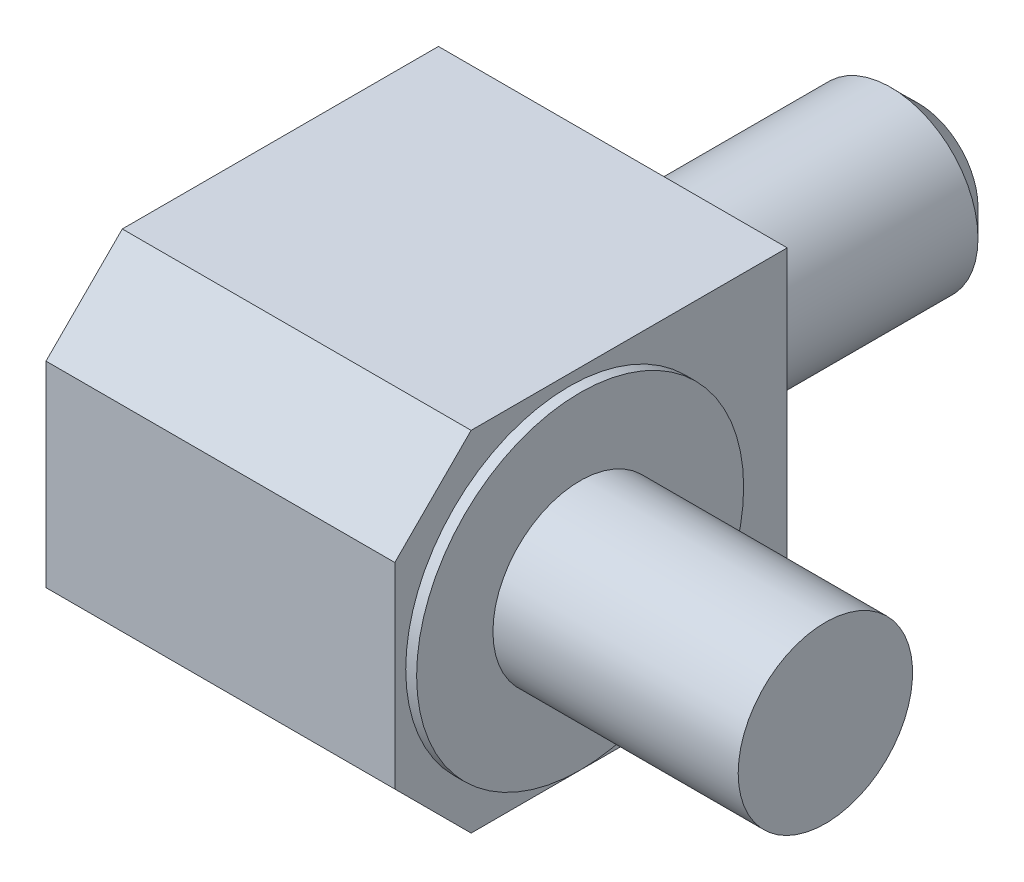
ISO-10303-21;
HEADER;
FILE_DESCRIPTION(('STEP AP214'),'2;1');
FILE_NAME('part.step','',(''),(''),'','','');
FILE_SCHEMA(('AUTOMOTIVE_DESIGN { 1 0 10303 214 1 1 1 1 }'));
ENDSEC;
DATA;
#1=APPLICATION_CONTEXT('core data for automotive mechanical design processes');
#2=APPLICATION_PROTOCOL_DEFINITION('international standard','automotive_design',2000,#1);
#3=PRODUCT_CONTEXT('',#1,'mechanical');
#4=PRODUCT('Part','Part','',(#3));
#5=PRODUCT_RELATED_PRODUCT_CATEGORY('part','',(#4));
#6=PRODUCT_DEFINITION_FORMATION('','',#4);
#7=PRODUCT_DEFINITION_CONTEXT('part definition',#1,'design');
#8=PRODUCT_DEFINITION('design','',#6,#7);
#9=PRODUCT_DEFINITION_SHAPE('','',#8);
#10=(LENGTH_UNIT() NAMED_UNIT(*) SI_UNIT(.MILLI.,.METRE.));
#11=(NAMED_UNIT(*) PLANE_ANGLE_UNIT() SI_UNIT($,.RADIAN.));
#12=(NAMED_UNIT(*) SI_UNIT($,.STERADIAN.) SOLID_ANGLE_UNIT());
#13=UNCERTAINTY_MEASURE_WITH_UNIT(LENGTH_MEASURE(1.E-05),#10,'distance_accuracy_value','');
#14=(GEOMETRIC_REPRESENTATION_CONTEXT(3) GLOBAL_UNCERTAINTY_ASSIGNED_CONTEXT((#13)) GLOBAL_UNIT_ASSIGNED_CONTEXT((#10,
#11,#12)) REPRESENTATION_CONTEXT('',''));
#15=CARTESIAN_POINT('',(0.,0.,0.));
#16=DIRECTION('',(0.,0.,1.));
#17=DIRECTION('',(1.,0.,0.));
#18=AXIS2_PLACEMENT_3D('',#15,#16,#17);
#19=CARTESIAN_POINT('',(8.,8.,0.));
#20=DIRECTION('',(-1.,0.,0.));
#21=DIRECTION('',(0.,0.,-1.));
#22=AXIS2_PLACEMENT_3D('',#19,#20,#21);
#23=PLANE('',#22);
#24=DIRECTION('',(0.,1.,0.));
#25=VECTOR('',#24,1.);
#26=CARTESIAN_POINT('',(8.,-8.,18.));
#27=LINE('',#26,#25);
#28=CARTESIAN_POINT('',(8.,-4.5,18.));
#29=VERTEX_POINT('',#28);
#30=CARTESIAN_POINT('',(8.,4.49999999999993,18.));
#31=VERTEX_POINT('',#30);
#32=EDGE_CURVE('E109',#29,#31,#27,.T.);
#33=ORIENTED_EDGE('',*,*,#32,.F.);
#34=DIRECTION('',(0.,-0.707106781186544,-0.707106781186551));
#35=VECTOR('',#34,1.);
#36=CARTESIAN_POINT('',(8.,-8.,14.5));
#37=LINE('',#36,#35);
#38=CARTESIAN_POINT('',(8.,-8.,14.5));
#39=VERTEX_POINT('',#38);
#40=EDGE_CURVE('E124',#29,#39,#37,.T.);
#41=ORIENTED_EDGE('',*,*,#40,.T.);
#42=DIRECTION('',(0.,0.,-1.));
#43=VECTOR('',#42,1.);
#44=CARTESIAN_POINT('',(8.,-8.,18.));
#45=LINE('',#44,#43);
#46=CARTESIAN_POINT('',(8.,-8.,0.));
#47=VERTEX_POINT('',#46);
#48=EDGE_CURVE('E107',#39,#47,#45,.T.);
#49=ORIENTED_EDGE('',*,*,#48,.T.);
#50=DIRECTION('',(0.,-1.,0.));
#51=VECTOR('',#50,1.);
#52=CARTESIAN_POINT('',(8.,8.,0.));
#53=LINE('',#52,#51);
#54=CARTESIAN_POINT('',(8.,8.,0.));
#55=VERTEX_POINT('',#54);
#56=EDGE_CURVE('E89',#55,#47,#53,.T.);
#57=ORIENTED_EDGE('',*,*,#56,.F.);
#58=DIRECTION('',(0.,0.,1.));
#59=VECTOR('',#58,1.);
#60=CARTESIAN_POINT('',(8.,8.,0.));
#61=LINE('',#60,#59);
#62=CARTESIAN_POINT('',(8.,8.,14.5));
#63=VERTEX_POINT('',#62);
#64=EDGE_CURVE('E91',#55,#63,#61,.T.);
#65=ORIENTED_EDGE('',*,*,#64,.T.);
#66=DIRECTION('',(0.,-0.707106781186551,0.707106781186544));
#67=VECTOR('',#66,1.);
#68=CARTESIAN_POINT('',(8.,4.49999999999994,18.));
#69=LINE('',#68,#67);
#70=EDGE_CURVE('E36',#63,#31,#69,.T.);
#71=ORIENTED_EDGE('',*,*,#70,.T.);
#72=EDGE_LOOP('',(#33,#41,#49,#57,#65,#71));
#73=FACE_BOUND('',#72,.T.);
#74=CARTESIAN_POINT('',(8.,0.,10.));
#75=DIRECTION('',(-1.,0.,0.));
#76=DIRECTION('',(0.,0.,-1.));
#77=AXIS2_PLACEMENT_3D('',#74,#75,#76);
#78=CIRCLE('',#77,7.5);
#79=CARTESIAN_POINT('',(8.,0.,2.5));
#80=VERTEX_POINT('',#79);
#81=EDGE_CURVE('E130',#80,#80,#78,.F.);
#82=ORIENTED_EDGE('',*,*,#81,.F.);
#83=EDGE_LOOP('',(#82));
#84=FACE_BOUND('',#83,.T.);
#85=ADVANCED_FACE('F14',(#73,#84),#23,.F.);
#86=CARTESIAN_POINT('',(8.,8.,0.));
#87=DIRECTION('',(0.,0.,-1.));
#88=DIRECTION('',(1.,0.,0.));
#89=AXIS2_PLACEMENT_3D('',#86,#87,#88);
#90=PLANE('',#89);
#91=CARTESIAN_POINT('',(0.,0.,0.));
#92=DIRECTION('',(0.,0.,-1.));
#93=DIRECTION('',(1.,0.,0.));
#94=AXIS2_PLACEMENT_3D('',#91,#92,#93);
#95=CIRCLE('',#94,4.);
#96=CARTESIAN_POINT('',(4.,0.,0.));
#97=VERTEX_POINT('',#96);
#98=EDGE_CURVE('E101',#97,#97,#95,.T.);
#99=ORIENTED_EDGE('',*,*,#98,.F.);
#100=EDGE_LOOP('',(#99));
#101=FACE_BOUND('',#100,.T.);
#102=DIRECTION('',(-1.,0.,0.));
#103=VECTOR('',#102,1.);
#104=CARTESIAN_POINT('',(8.,8.,0.));
#105=LINE('',#104,#103);
#106=CARTESIAN_POINT('',(-8.,8.,0.));
#107=VERTEX_POINT('',#106);
#108=EDGE_CURVE('E90',#55,#107,#105,.T.);
#109=ORIENTED_EDGE('',*,*,#108,.F.);
#110=ORIENTED_EDGE('',*,*,#56,.T.);
#111=DIRECTION('',(-1.,0.,0.));
#112=VECTOR('',#111,1.);
#113=CARTESIAN_POINT('',(8.,-8.,0.));
#114=LINE('',#113,#112);
#115=CARTESIAN_POINT('',(-8.,-8.,0.));
#116=VERTEX_POINT('',#115);
#117=EDGE_CURVE('E75',#47,#116,#114,.T.);
#118=ORIENTED_EDGE('',*,*,#117,.T.);
#119=DIRECTION('',(0.,-1.,0.));
#120=VECTOR('',#119,1.);
#121=CARTESIAN_POINT('',(-8.,8.,0.));
#122=LINE('',#121,#120);
#123=EDGE_CURVE('E82',#107,#116,#122,.T.);
#124=ORIENTED_EDGE('',*,*,#123,.F.);
#125=EDGE_LOOP('',(#109,#110,#118,#124));
#126=FACE_BOUND('',#125,.T.);
#127=ADVANCED_FACE('F86',(#101,#126),#90,.T.);
#128=CARTESIAN_POINT('',(8.,8.,0.));
#129=DIRECTION('',(0.,-1.,0.));
#130=DIRECTION('',(1.,0.,0.));
#131=AXIS2_PLACEMENT_3D('',#128,#129,#130);
#132=PLANE('',#131);
#133=DIRECTION('',(0.,0.,1.));
#134=VECTOR('',#133,1.);
#135=CARTESIAN_POINT('',(-8.,8.,0.));
#136=LINE('',#135,#134);
#137=CARTESIAN_POINT('',(-8.,8.,14.5));
#138=VERTEX_POINT('',#137);
#139=EDGE_CURVE('E94',#107,#138,#136,.T.);
#140=ORIENTED_EDGE('',*,*,#139,.T.);
#141=DIRECTION('',(1.,0.,0.));
#142=VECTOR('',#141,1.);
#143=CARTESIAN_POINT('',(8.,8.,14.5));
#144=LINE('',#143,#142);
#145=EDGE_CURVE('E29',#138,#63,#144,.T.);
#146=ORIENTED_EDGE('',*,*,#145,.T.);
#147=ORIENTED_EDGE('',*,*,#64,.F.);
#148=ORIENTED_EDGE('',*,*,#108,.T.);
#149=EDGE_LOOP('',(#140,#146,#147,#148));
#150=FACE_BOUND('',#149,.T.);
#151=ADVANCED_FACE('F155',(#150),#132,.F.);
#152=CARTESIAN_POINT('',(8.,-8.,18.));
#153=DIRECTION('',(0.,0.,1.));
#154=DIRECTION('',(0.,-1.,0.));
#155=AXIS2_PLACEMENT_3D('',#152,#153,#154);
#156=PLANE('',#155);
#157=DIRECTION('',(0.,1.,0.));
#158=VECTOR('',#157,1.);
#159=CARTESIAN_POINT('',(-8.,-8.,18.));
#160=LINE('',#159,#158);
#161=CARTESIAN_POINT('',(-8.,-4.5,18.));
#162=VERTEX_POINT('',#161);
#163=CARTESIAN_POINT('',(-8.,4.49999999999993,18.));
#164=VERTEX_POINT('',#163);
#165=EDGE_CURVE('E81',#162,#164,#160,.T.);
#166=ORIENTED_EDGE('',*,*,#165,.F.);
#167=DIRECTION('',(1.,0.,0.));
#168=VECTOR('',#167,1.);
#169=CARTESIAN_POINT('',(8.,-4.5,18.));
#170=LINE('',#169,#168);
#171=EDGE_CURVE('E121',#162,#29,#170,.T.);
#172=ORIENTED_EDGE('',*,*,#171,.T.);
#173=ORIENTED_EDGE('',*,*,#32,.T.);
#174=DIRECTION('',(-1.,0.,0.));
#175=VECTOR('',#174,1.);
#176=CARTESIAN_POINT('',(-8.,4.49999999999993,18.));
#177=LINE('',#176,#175);
#178=EDGE_CURVE('E118',#31,#164,#177,.T.);
#179=ORIENTED_EDGE('',*,*,#178,.T.);
#180=EDGE_LOOP('',(#166,#172,#173,#179));
#181=FACE_BOUND('',#180,.T.);
#182=ADVANCED_FACE('F164',(#181),#156,.T.);
#183=CARTESIAN_POINT('',(8.,-8.,18.));
#184=DIRECTION('',(0.,1.,0.));
#185=DIRECTION('',(0.,0.,1.));
#186=AXIS2_PLACEMENT_3D('',#183,#184,#185);
#187=PLANE('',#186);
#188=ORIENTED_EDGE('',*,*,#48,.F.);
#189=DIRECTION('',(-1.,0.,0.));
#190=VECTOR('',#189,1.);
#191=CARTESIAN_POINT('',(-8.,-8.,14.5));
#192=LINE('',#191,#190);
#193=CARTESIAN_POINT('',(-8.,-8.,14.5));
#194=VERTEX_POINT('',#193);
#195=EDGE_CURVE('E78',#39,#194,#192,.T.);
#196=ORIENTED_EDGE('',*,*,#195,.T.);
#197=DIRECTION('',(0.,0.,-1.));
#198=VECTOR('',#197,1.);
#199=CARTESIAN_POINT('',(-8.,-8.,18.));
#200=LINE('',#199,#198);
#201=EDGE_CURVE('E71',#194,#116,#200,.T.);
#202=ORIENTED_EDGE('',*,*,#201,.T.);
#203=ORIENTED_EDGE('',*,*,#117,.F.);
#204=EDGE_LOOP('',(#188,#196,#202,#203));
#205=FACE_BOUND('',#204,.T.);
#206=ADVANCED_FACE('F74',(#205),#187,.F.);
#207=CARTESIAN_POINT('',(-8.,8.,0.));
#208=DIRECTION('',(-1.,0.,0.));
#209=DIRECTION('',(0.,0.,-1.));
#210=AXIS2_PLACEMENT_3D('',#207,#208,#209);
#211=PLANE('',#210);
#212=ORIENTED_EDGE('',*,*,#201,.F.);
#213=DIRECTION('',(0.,0.707106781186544,0.707106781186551));
#214=VECTOR('',#213,1.);
#215=CARTESIAN_POINT('',(-8.,-7.25,15.25));
#216=LINE('',#215,#214);
#217=EDGE_CURVE('E116',#194,#162,#216,.T.);
#218=ORIENTED_EDGE('',*,*,#217,.T.);
#219=ORIENTED_EDGE('',*,*,#165,.T.);
#220=DIRECTION('',(0.,0.707106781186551,-0.707106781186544));
#221=VECTOR('',#220,1.);
#222=CARTESIAN_POINT('',(-8.,15.25,7.25));
#223=LINE('',#222,#221);
#224=EDGE_CURVE('E114',#164,#138,#223,.T.);
#225=ORIENTED_EDGE('',*,*,#224,.T.);
#226=ORIENTED_EDGE('',*,*,#139,.F.);
#227=ORIENTED_EDGE('',*,*,#123,.T.);
#228=EDGE_LOOP('',(#212,#218,#219,#225,#226,#227));
#229=FACE_BOUND('',#228,.T.);
#230=ADVANCED_FACE('F93',(#229),#211,.T.);
#231=CARTESIAN_POINT('',(8.,-8.,14.5));
#232=DIRECTION('',(0.,-0.707106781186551,0.707106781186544));
#233=DIRECTION('',(0.,-0.707106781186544,-0.707106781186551));
#234=AXIS2_PLACEMENT_3D('',#231,#232,#233);
#235=PLANE('',#234);
#236=ORIENTED_EDGE('',*,*,#40,.F.);
#237=ORIENTED_EDGE('',*,*,#171,.F.);
#238=ORIENTED_EDGE('',*,*,#217,.F.);
#239=ORIENTED_EDGE('',*,*,#195,.F.);
#240=EDGE_LOOP('',(#236,#237,#238,#239));
#241=FACE_BOUND('',#240,.T.);
#242=ADVANCED_FACE('F178',(#241),#235,.T.);
#243=CARTESIAN_POINT('',(8.,4.49999999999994,18.));
#244=DIRECTION('',(0.,0.707106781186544,0.707106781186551));
#245=DIRECTION('',(0.,-0.707106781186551,0.707106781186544));
#246=AXIS2_PLACEMENT_3D('',#243,#244,#245);
#247=PLANE('',#246);
#248=ORIENTED_EDGE('',*,*,#70,.F.);
#249=ORIENTED_EDGE('',*,*,#145,.F.);
#250=ORIENTED_EDGE('',*,*,#224,.F.);
#251=ORIENTED_EDGE('',*,*,#178,.F.);
#252=EDGE_LOOP('',(#248,#249,#250,#251));
#253=FACE_BOUND('',#252,.T.);
#254=ADVANCED_FACE('F172',(#253),#247,.T.);
#255=CARTESIAN_POINT('',(0.,0.,-14.));
#256=DIRECTION('',(0.,0.,1.));
#257=DIRECTION('',(-1.,0.,0.));
#258=AXIS2_PLACEMENT_3D('',#255,#256,#257);
#259=CYLINDRICAL_SURFACE('',#258,4.);
#260=CARTESIAN_POINT('',(0.,0.,-12.75));
#261=DIRECTION('',(0.,0.,-1.));
#262=DIRECTION('',(1.,0.,0.));
#263=AXIS2_PLACEMENT_3D('',#260,#261,#262);
#264=CIRCLE('',#263,4.);
#265=CARTESIAN_POINT('',(4.,0.,-12.75));
#266=VERTEX_POINT('',#265);
#267=EDGE_CURVE('E9',#266,#266,#264,.F.);
#268=ORIENTED_EDGE('',*,*,#267,.T.);
#269=EDGE_LOOP('',(#268));
#270=FACE_BOUND('',#269,.T.);
#271=ORIENTED_EDGE('',*,*,#98,.T.);
#272=EDGE_LOOP('',(#271));
#273=FACE_BOUND('',#272,.T.);
#274=ADVANCED_FACE('F185',(#270,#273),#259,.T.);
#275=CARTESIAN_POINT('',(0.,0.,-14.));
#276=DIRECTION('',(0.,0.,-1.));
#277=DIRECTION('',(1.,0.,0.));
#278=AXIS2_PLACEMENT_3D('',#275,#276,#277);
#279=PLANE('',#278);
#280=CARTESIAN_POINT('',(0.,0.,-14.));
#281=DIRECTION('',(0.,0.,-1.));
#282=DIRECTION('',(1.,0.,0.));
#283=AXIS2_PLACEMENT_3D('',#280,#281,#282);
#284=CIRCLE('',#283,2.75);
#285=CARTESIAN_POINT('',(2.75,0.,-14.));
#286=VERTEX_POINT('',#285);
#287=EDGE_CURVE('E22',#286,#286,#284,.T.);
#288=ORIENTED_EDGE('',*,*,#287,.T.);
#289=EDGE_LOOP('',(#288));
#290=FACE_BOUND('',#289,.T.);
#291=ADVANCED_FACE('F135',(#290),#279,.T.);
#292=CARTESIAN_POINT('',(8.5,0.,10.));
#293=DIRECTION('',(1.,0.,0.));
#294=DIRECTION('',(0.,0.,1.));
#295=AXIS2_PLACEMENT_3D('',#292,#293,#294);
#296=PLANE('',#295);
#297=CARTESIAN_POINT('',(8.5,0.,10.));
#298=DIRECTION('',(1.,0.,0.));
#299=DIRECTION('',(0.,0.,1.));
#300=AXIS2_PLACEMENT_3D('',#297,#298,#299);
#301=CIRCLE('',#300,7.5);
#302=CARTESIAN_POINT('',(8.5,0.,17.5));
#303=VERTEX_POINT('',#302);
#304=EDGE_CURVE('E129',#303,#303,#301,.T.);
#305=ORIENTED_EDGE('',*,*,#304,.T.);
#306=EDGE_LOOP('',(#305));
#307=FACE_BOUND('',#306,.T.);
#308=CARTESIAN_POINT('',(8.5,0.,10.));
#309=DIRECTION('',(1.,0.,0.));
#310=DIRECTION('',(0.,0.,1.));
#311=AXIS2_PLACEMENT_3D('',#308,#309,#310);
#312=CIRCLE('',#311,4.);
#313=CARTESIAN_POINT('',(8.5,0.,14.));
#314=VERTEX_POINT('',#313);
#315=EDGE_CURVE('E98',#314,#314,#312,.T.);
#316=ORIENTED_EDGE('',*,*,#315,.F.);
#317=EDGE_LOOP('',(#316));
#318=FACE_BOUND('',#317,.T.);
#319=ADVANCED_FACE('F191',(#307,#318),#296,.T.);
#320=CARTESIAN_POINT('',(8.5,0.,10.));
#321=DIRECTION('',(-1.,0.,0.));
#322=DIRECTION('',(0.,0.,-1.));
#323=AXIS2_PLACEMENT_3D('',#320,#321,#322);
#324=CYLINDRICAL_SURFACE('',#323,7.5);
#325=ORIENTED_EDGE('',*,*,#304,.F.);
#326=EDGE_LOOP('',(#325));
#327=FACE_BOUND('',#326,.T.);
#328=ORIENTED_EDGE('',*,*,#81,.T.);
#329=EDGE_LOOP('',(#328));
#330=FACE_BOUND('',#329,.T.);
#331=ADVANCED_FACE('F196',(#327,#330),#324,.T.);
#332=CARTESIAN_POINT('',(19.75,0.,10.));
#333=DIRECTION('',(1.,0.,0.));
#334=DIRECTION('',(0.,0.,1.));
#335=AXIS2_PLACEMENT_3D('',#332,#333,#334);
#336=PLANE('',#335);
#337=CARTESIAN_POINT('',(19.75,0.,10.));
#338=DIRECTION('',(1.,0.,0.));
#339=DIRECTION('',(0.,0.,1.));
#340=AXIS2_PLACEMENT_3D('',#337,#338,#339);
#341=CIRCLE('',#340,4.);
#342=CARTESIAN_POINT('',(19.75,0.,14.));
#343=VERTEX_POINT('',#342);
#344=EDGE_CURVE('E95',#343,#343,#341,.T.);
#345=ORIENTED_EDGE('',*,*,#344,.T.);
#346=EDGE_LOOP('',(#345));
#347=FACE_BOUND('',#346,.T.);
#348=ADVANCED_FACE('F145',(#347),#336,.T.);
#349=CARTESIAN_POINT('',(19.75,0.,10.));
#350=DIRECTION('',(-1.,0.,0.));
#351=DIRECTION('',(0.,0.,-1.));
#352=AXIS2_PLACEMENT_3D('',#349,#350,#351);
#353=CYLINDRICAL_SURFACE('',#352,4.);
#354=ORIENTED_EDGE('',*,*,#315,.T.);
#355=EDGE_LOOP('',(#354));
#356=FACE_BOUND('',#355,.T.);
#357=ORIENTED_EDGE('',*,*,#344,.F.);
#358=EDGE_LOOP('',(#357));
#359=FACE_BOUND('',#358,.T.);
#360=ADVANCED_FACE('F138',(#356,#359),#353,.T.);
#361=CARTESIAN_POINT('',(0.,0.,-14.));
#362=DIRECTION('',(0.,0.,1.));
#363=DIRECTION('',(-1.,0.,0.));
#364=AXIS2_PLACEMENT_3D('',#361,#362,#363);
#365=CONICAL_SURFACE('',#364,2.75,0.785398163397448);
#366=ORIENTED_EDGE('',*,*,#267,.F.);
#367=EDGE_LOOP('',(#366));
#368=FACE_BOUND('',#367,.T.);
#369=ORIENTED_EDGE('',*,*,#287,.F.);
#370=EDGE_LOOP('',(#369));
#371=FACE_BOUND('',#370,.T.);
#372=ADVANCED_FACE('F16',(#368,#371),#365,.T.);
#373=CLOSED_SHELL('',(#85,#127,#151,#182,#206,#230,#242,#254,#274,#291,#319,#331,#348,#360,#372));
#374=MANIFOLD_SOLID_BREP('B1',#373);
#375=ADVANCED_BREP_SHAPE_REPRESENTATION('',(#18,#374),#14);
#376=SHAPE_DEFINITION_REPRESENTATION(#9,#375);
ENDSEC;
END-ISO-10303-21;
